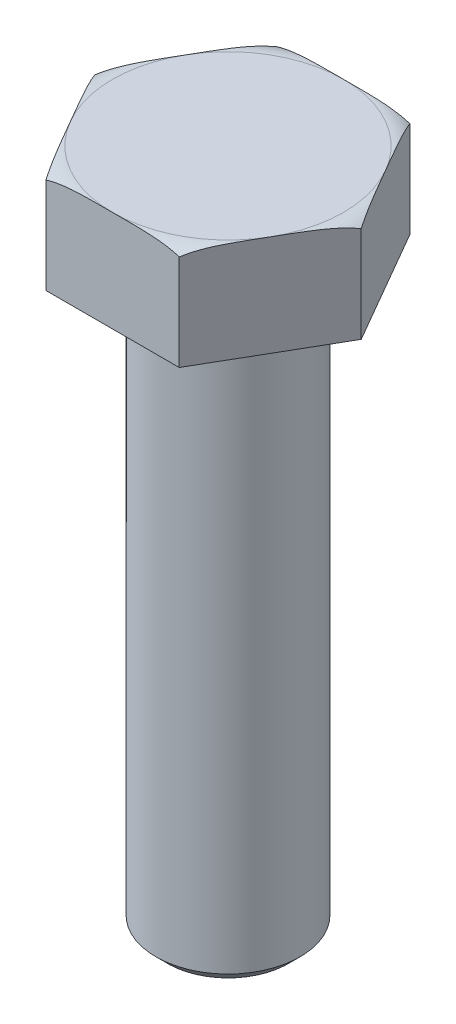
ISO-10303-21;
HEADER;
FILE_DESCRIPTION(('STEP AP214'),'2;1');
FILE_NAME('part.step','',(''),(''),'','','');
FILE_SCHEMA(('AUTOMOTIVE_DESIGN { 1 0 10303 214 1 1 1 1 }'));
ENDSEC;
DATA;
#1=APPLICATION_CONTEXT('core data for automotive mechanical design processes');
#2=APPLICATION_PROTOCOL_DEFINITION('international standard','automotive_design',2000,#1);
#3=PRODUCT_CONTEXT('',#1,'mechanical');
#4=PRODUCT('Part','Part','',(#3));
#5=PRODUCT_RELATED_PRODUCT_CATEGORY('part','',(#4));
#6=PRODUCT_DEFINITION_FORMATION('','',#4);
#7=PRODUCT_DEFINITION_CONTEXT('part definition',#1,'design');
#8=PRODUCT_DEFINITION('design','',#6,#7);
#9=PRODUCT_DEFINITION_SHAPE('','',#8);
#10=(LENGTH_UNIT() NAMED_UNIT(*) SI_UNIT(.MILLI.,.METRE.));
#11=(NAMED_UNIT(*) PLANE_ANGLE_UNIT() SI_UNIT($,.RADIAN.));
#12=(NAMED_UNIT(*) SI_UNIT($,.STERADIAN.) SOLID_ANGLE_UNIT());
#13=UNCERTAINTY_MEASURE_WITH_UNIT(LENGTH_MEASURE(1.E-05),#10,'distance_accuracy_value','');
#14=(GEOMETRIC_REPRESENTATION_CONTEXT(3) GLOBAL_UNCERTAINTY_ASSIGNED_CONTEXT((#13)) GLOBAL_UNIT_ASSIGNED_CONTEXT((#10,
#11,#12)) REPRESENTATION_CONTEXT('',''));
#15=CARTESIAN_POINT('',(0.,0.,0.));
#16=DIRECTION('',(0.,0.,1.));
#17=DIRECTION('',(1.,0.,0.));
#18=AXIS2_PLACEMENT_3D('',#15,#16,#17);
#19=CARTESIAN_POINT('',(2.1,-20.,0.));
#20=DIRECTION('',(0.,1.,0.));
#21=DIRECTION('',(-1.,0.,0.));
#22=AXIS2_PLACEMENT_3D('',#19,#20,#21);
#23=PLANE('',#22);
#24=CARTESIAN_POINT('',(0.,-20.,0.));
#25=DIRECTION('',(0.,1.,0.));
#26=DIRECTION('',(-1.,0.,0.));
#27=AXIS2_PLACEMENT_3D('',#24,#25,#26);
#28=CIRCLE('',#27,2.1);
#29=CARTESIAN_POINT('',(-2.1,-20.,0.));
#30=VERTEX_POINT('',#29);
#31=EDGE_CURVE('E13',#30,#30,#28,.T.);
#32=ORIENTED_EDGE('',*,*,#31,.F.);
#33=EDGE_LOOP('',(#32));
#34=FACE_BOUND('',#33,.T.);
#35=ADVANCED_FACE('F59',(#34),#23,.F.);
#36=CARTESIAN_POINT('',(0.,-20.,0.));
#37=DIRECTION('',(0.,1.,0.));
#38=DIRECTION('',(-1.,0.,0.));
#39=AXIS2_PLACEMENT_3D('',#36,#37,#38);
#40=CONICAL_SURFACE('',#39,2.1,0.785398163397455);
#41=CARTESIAN_POINT('',(0.,-19.6,0.));
#42=DIRECTION('',(0.,1.,0.));
#43=DIRECTION('',(-1.,0.,0.));
#44=AXIS2_PLACEMENT_3D('',#41,#42,#43);
#45=CIRCLE('',#44,2.5);
#46=CARTESIAN_POINT('',(-2.5,-19.6,0.));
#47=VERTEX_POINT('',#46);
#48=EDGE_CURVE('E65',#47,#47,#45,.T.);
#49=ORIENTED_EDGE('',*,*,#48,.F.);
#50=EDGE_LOOP('',(#49));
#51=FACE_BOUND('',#50,.T.);
#52=ORIENTED_EDGE('',*,*,#31,.T.);
#53=EDGE_LOOP('',(#52));
#54=FACE_BOUND('',#53,.T.);
#55=ADVANCED_FACE('F92',(#51,#54),#40,.T.);
#56=CARTESIAN_POINT('',(0.,0.,0.));
#57=DIRECTION('',(0.,1.,0.));
#58=DIRECTION('',(-1.,0.,0.));
#59=AXIS2_PLACEMENT_3D('',#56,#57,#58);
#60=CYLINDRICAL_SURFACE('',#59,2.5);
#61=CARTESIAN_POINT('',(0.,-0.25,0.));
#62=DIRECTION('',(0.,1.,0.));
#63=DIRECTION('',(-1.,0.,0.));
#64=AXIS2_PLACEMENT_3D('',#61,#62,#63);
#65=CIRCLE('',#64,2.5);
#66=CARTESIAN_POINT('',(-2.49999999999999,-0.25,0.));
#67=VERTEX_POINT('',#66);
#68=EDGE_CURVE('E69',#67,#67,#65,.T.);
#69=ORIENTED_EDGE('',*,*,#68,.F.);
#70=EDGE_LOOP('',(#69));
#71=FACE_BOUND('',#70,.T.);
#72=ORIENTED_EDGE('',*,*,#48,.T.);
#73=EDGE_LOOP('',(#72));
#74=FACE_BOUND('',#73,.T.);
#75=ADVANCED_FACE('F87',(#71,#74),#60,.T.);
#76=CARTESIAN_POINT('',(0.,-0.25,0.));
#77=DIRECTION('',(0.,1.,0.));
#78=DIRECTION('',(-1.,0.,0.));
#79=AXIS2_PLACEMENT_3D('',#76,#77,#78);
#80=TOROIDAL_SURFACE('',#79,2.75,0.25);
#81=CARTESIAN_POINT('',(0.,0.,0.));
#82=DIRECTION('',(0.,1.,0.));
#83=DIRECTION('',(-1.,0.,0.));
#84=AXIS2_PLACEMENT_3D('',#81,#82,#83);
#85=CIRCLE('',#84,2.75);
#86=CARTESIAN_POINT('',(-2.74999999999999,0.,0.));
#87=VERTEX_POINT('',#86);
#88=EDGE_CURVE('E73',#87,#87,#85,.T.);
#89=ORIENTED_EDGE('',*,*,#88,.F.);
#90=EDGE_LOOP('',(#89));
#91=FACE_BOUND('',#90,.T.);
#92=ORIENTED_EDGE('',*,*,#68,.T.);
#93=EDGE_LOOP('',(#92));
#94=FACE_BOUND('',#93,.T.);
#95=ADVANCED_FACE('F84',(#91,#94),#80,.F.);
#96=CARTESIAN_POINT('',(0.,0.,0.));
#97=DIRECTION('',(0.,-1.,0.));
#98=DIRECTION('',(1.,0.,0.));
#99=AXIS2_PLACEMENT_3D('',#96,#97,#98);
#100=PLANE('',#99);
#101=ORIENTED_EDGE('',*,*,#88,.T.);
#102=EDGE_LOOP('',(#101));
#103=FACE_BOUND('',#102,.T.);
#104=ADVANCED_FACE('F82',(#103),#100,.F.);
#105=CLOSED_SHELL('',(#35,#55,#75,#95,#104));
#106=MANIFOLD_SOLID_BREP('B2',#105);
#107=CARTESIAN_POINT('',(2.3094010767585,3.5,4.));
#108=DIRECTION('',(-0.866025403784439,0.,-0.5));
#109=DIRECTION('',(-0.5,0.,0.866025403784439));
#110=AXIS2_PLACEMENT_3D('',#107,#108,#109);
#111=PLANE('',#110);
#112=CARTESIAN_POINT('',(2.30928560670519,3.32229848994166,4.00019999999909));
#113=CARTESIAN_POINT('',(2.33858994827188,3.34061994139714,3.94944339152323));
#114=CARTESIAN_POINT('',(2.36819944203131,3.35683646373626,3.8981582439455));
#115=CARTESIAN_POINT('',(2.42782076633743,3.38563718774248,3.79489108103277));
#116=CARTESIAN_POINT('',(2.4578320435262,3.39822593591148,3.74291002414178));
#117=CARTESIAN_POINT('',(2.51792993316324,3.42032057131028,3.63881742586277));
#118=CARTESIAN_POINT('',(2.54801482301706,3.42984574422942,3.58670886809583));
#119=CARTESIAN_POINT('',(2.60836185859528,3.44643059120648,3.48218473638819));
#120=CARTESIAN_POINT('',(2.63862406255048,3.45348940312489,3.42976906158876));
#121=CARTESIAN_POINT('',(2.72922878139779,3.47159999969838,3.27283708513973));
#122=CARTESIAN_POINT('',(2.78971625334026,3.47969499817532,3.16806971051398));
#123=CARTESIAN_POINT('',(2.91090807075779,3.49106106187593,2.95815932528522));
#124=CARTESIAN_POINT('',(2.97161260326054,3.49432175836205,2.85301599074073));
#125=CARTESIAN_POINT('',(3.0983551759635,3.4985657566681,2.6334914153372));
#126=CARTESIAN_POINT('',(3.16439466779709,3.49932457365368,2.5191076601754));
#127=CARTESIAN_POINT('',(3.29646606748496,3.5000407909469,2.29035328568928));
#128=CARTESIAN_POINT('',(3.36249797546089,3.49999826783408,2.17598266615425));
#129=CARTESIAN_POINT('',(3.49443332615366,3.50000138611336,1.94746393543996));
#130=CARTESIAN_POINT('',(3.56033676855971,3.5000468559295,1.83331582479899));
#131=CARTESIAN_POINT('',(3.69217755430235,3.499805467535,1.60496088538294));
#132=CARTESIAN_POINT('',(3.75811489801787,3.4995184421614,1.49075405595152));
#133=CARTESIAN_POINT('',(3.89072417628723,3.49692440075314,1.26106804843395));
#134=CARTESIAN_POINT('',(3.95739603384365,3.4945947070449,1.14558900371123));
#135=CARTESIAN_POINT('',(4.09058235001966,3.4850462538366,0.914903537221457));
#136=CARTESIAN_POINT('',(4.15709689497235,3.47783480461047,0.799696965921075));
#137=CARTESIAN_POINT('',(4.25676848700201,3.46042721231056,0.627060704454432));
#138=CARTESIAN_POINT('',(4.29006368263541,3.45349911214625,0.569391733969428));
#139=CARTESIAN_POINT('',(4.35646708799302,3.43683502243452,0.454377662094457));
#140=CARTESIAN_POINT('',(4.389575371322,3.42710023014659,0.397032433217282));
#141=CARTESIAN_POINT('',(4.45567964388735,3.40410862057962,0.282536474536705));
#142=CARTESIAN_POINT('',(4.48867406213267,3.39083307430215,0.22538846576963));
#143=CARTESIAN_POINT('',(4.55420607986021,3.35998613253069,0.111883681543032));
#144=CARTESIAN_POINT('',(4.58674289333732,3.34240812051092,0.0555282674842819));
#145=CARTESIAN_POINT('',(4.61891762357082,3.32229848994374,-0.000199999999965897));
#146=B_SPLINE_CURVE_WITH_KNOTS('',3,(#112,#113,#114,#115,#116,#117,#118,#119,#120,#121,#122,
#123,#124,#125,#126,#127,#128,#129,#130,#131,#132,#133,#134,#135,#136,#137,#138,#139,#140,#141,
#142,#143,#144,#145),.UNSPECIFIED.,.F.,.F.,(4,2,2,2,2,2,2,2,2,2,2,2,2,2,2,2,4),(0.,
0.184112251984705,0.367992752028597,0.550691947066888,0.733454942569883,1.09699737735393,
1.46131842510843,1.85754929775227,2.25374230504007,2.64916356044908,3.04478370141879,
3.44485242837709,3.84432338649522,4.04512521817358,4.24584151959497,4.44764133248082,
4.64975345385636),.UNSPECIFIED.);
#147=CARTESIAN_POINT('',(2.30940107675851,3.32237074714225,4.));
#148=VERTEX_POINT('',#147);
#149=CARTESIAN_POINT('',(3.46410161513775,3.5,2.));
#150=VERTEX_POINT('',#149);
#151=EDGE_CURVE('E221',#148,#150,#146,.T.);
#152=ORIENTED_EDGE('',*,*,#151,.F.);
#153=DIRECTION('',(0.,-1.,0.));
#154=VECTOR('',#153,1.);
#155=CARTESIAN_POINT('',(2.3094010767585,3.5,4.));
#156=LINE('',#155,#154);
#157=CARTESIAN_POINT('',(2.3094010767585,0.,4.));
#158=VERTEX_POINT('',#157);
#159=EDGE_CURVE('E447',#148,#158,#156,.T.);
#160=ORIENTED_EDGE('',*,*,#159,.T.);
#161=DIRECTION('',(0.5,0.,-0.866025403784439));
#162=VECTOR('',#161,1.);
#163=CARTESIAN_POINT('',(2.3094010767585,0.,4.));
#164=LINE('',#163,#162);
#165=CARTESIAN_POINT('',(4.61880215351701,0.,0.));
#166=VERTEX_POINT('',#165);
#167=EDGE_CURVE('E234',#158,#166,#164,.T.);
#168=ORIENTED_EDGE('',*,*,#167,.T.);
#169=DIRECTION('',(0.,-1.,0.));
#170=VECTOR('',#169,1.);
#171=CARTESIAN_POINT('',(4.61880215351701,3.5,0.));
#172=LINE('',#171,#170);
#173=CARTESIAN_POINT('',(4.61880215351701,3.32237074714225,0.));
#174=VERTEX_POINT('',#173);
#175=EDGE_CURVE('E227',#174,#166,#172,.T.);
#176=ORIENTED_EDGE('',*,*,#175,.F.);
#177=EDGE_CURVE('E211',#150,#174,#146,.T.);
#178=ORIENTED_EDGE('',*,*,#177,.F.);
#179=EDGE_LOOP('',(#152,#160,#168,#176,#178));
#180=FACE_BOUND('',#179,.T.);
#181=ADVANCED_FACE('F138',(#180),#111,.F.);
#182=CARTESIAN_POINT('',(4.61880215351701,3.5,0.));
#183=DIRECTION('',(-0.866025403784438,0.,0.5));
#184=DIRECTION('',(0.5,0.,0.866025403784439));
#185=AXIS2_PLACEMENT_3D('',#182,#183,#184);
#186=PLANE('',#185);
#187=CARTESIAN_POINT('',(4.61891762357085,3.32229848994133,0.000199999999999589));
#188=CARTESIAN_POINT('',(4.58961328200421,3.34061994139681,-0.050556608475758));
#189=CARTESIAN_POINT('',(4.56000378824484,3.35683646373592,-0.101841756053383));
#190=CARTESIAN_POINT('',(4.50038246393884,3.38563718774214,-0.205108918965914));
#191=CARTESIAN_POINT('',(4.47037118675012,3.39822593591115,-0.257089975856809));
#192=CARTESIAN_POINT('',(4.41027329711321,3.42032057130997,-0.36118257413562));
#193=CARTESIAN_POINT('',(4.38018840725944,3.42984574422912,-0.413291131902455));
#194=CARTESIAN_POINT('',(4.31984137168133,3.4464305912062,-0.5178152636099));
#195=CARTESIAN_POINT('',(4.28957916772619,3.45348940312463,-0.57023093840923));
#196=CARTESIAN_POINT('',(4.19897444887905,3.47159999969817,-0.727162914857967));
#197=CARTESIAN_POINT('',(4.13848697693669,3.47969499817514,-0.831930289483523));
#198=CARTESIAN_POINT('',(4.01729515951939,3.49106106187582,-1.0418406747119));
#199=CARTESIAN_POINT('',(3.95659062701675,3.49432175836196,-1.1469840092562));
#200=CARTESIAN_POINT('',(3.82984805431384,3.49856575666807,-1.36650858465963));
#201=CARTESIAN_POINT('',(3.76380856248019,3.49932457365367,-1.48089233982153));
#202=CARTESIAN_POINT('',(3.63173716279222,3.5000407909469,-1.70964671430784));
#203=CARTESIAN_POINT('',(3.56570525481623,3.49999826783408,-1.82401733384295));
#204=CARTESIAN_POINT('',(3.43376990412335,3.50000138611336,-2.05253606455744));
#205=CARTESIAN_POINT('',(3.36786646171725,3.5000468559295,-2.16668417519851));
#206=CARTESIAN_POINT('',(3.2360256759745,3.49980546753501,-2.39503911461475));
#207=CARTESIAN_POINT('',(3.17008833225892,3.49951844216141,-2.50924594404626));
#208=CARTESIAN_POINT('',(3.03747905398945,3.49692440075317,-2.73893195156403));
#209=CARTESIAN_POINT('',(2.97080719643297,3.49459470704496,-2.85441099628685));
#210=CARTESIAN_POINT('',(2.83762088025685,3.4850462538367,-3.08509646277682));
#211=CARTESIAN_POINT('',(2.7711063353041,3.47783480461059,-3.2003030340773));
#212=CARTESIAN_POINT('',(2.67143474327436,3.46042721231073,-3.37293929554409));
#213=CARTESIAN_POINT('',(2.63813954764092,3.45349911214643,-3.43060826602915));
#214=CARTESIAN_POINT('',(2.57173614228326,3.43683502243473,-3.54562233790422));
#215=CARTESIAN_POINT('',(2.53862785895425,3.42710023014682,-3.60296756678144));
#216=CARTESIAN_POINT('',(2.47252358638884,3.40410862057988,-3.71746352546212));
#217=CARTESIAN_POINT('',(2.43952916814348,3.39083307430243,-3.77461153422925));
#218=CARTESIAN_POINT('',(2.37399715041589,3.359986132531,-3.88811631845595));
#219=CARTESIAN_POINT('',(2.34146033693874,3.34240812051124,-3.94447173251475));
#220=CARTESIAN_POINT('',(2.30928560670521,3.32229848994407,-4.00019999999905));
#221=B_SPLINE_CURVE_WITH_KNOTS('',3,(#187,#188,#189,#190,#191,#192,#193,#194,#195,#196,#197,
#198,#199,#200,#201,#202,#203,#204,#205,#206,#207,#208,#209,#210,#211,#212,#213,#214,#215,#216,
#217,#218,#219,#220),.UNSPECIFIED.,.F.,.F.,(4,2,2,2,2,2,2,2,2,2,2,2,2,2,2,2,4),(0.,
0.184112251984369,0.367992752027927,0.550691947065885,0.733454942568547,1.09699737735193,
1.46131842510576,1.85754929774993,2.25374230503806,2.6491635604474,3.04478370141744,
3.44485242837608,3.84432338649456,4.04512521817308,4.24584151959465,4.44764133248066,
4.64975345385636),.UNSPECIFIED.);
#222=CARTESIAN_POINT('',(3.46410161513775,3.5,-2.));
#223=VERTEX_POINT('',#222);
#224=EDGE_CURVE('E214',#174,#223,#221,.T.);
#225=ORIENTED_EDGE('',*,*,#224,.F.);
#226=ORIENTED_EDGE('',*,*,#175,.T.);
#227=DIRECTION('',(-0.5,0.,-0.866025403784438));
#228=VECTOR('',#227,1.);
#229=CARTESIAN_POINT('',(4.61880215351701,0.,0.));
#230=LINE('',#229,#228);
#231=CARTESIAN_POINT('',(2.3094010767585,0.,-4.));
#232=VERTEX_POINT('',#231);
#233=EDGE_CURVE('E455',#166,#232,#230,.T.);
#234=ORIENTED_EDGE('',*,*,#233,.T.);
#235=DIRECTION('',(0.,-1.,0.));
#236=VECTOR('',#235,1.);
#237=CARTESIAN_POINT('',(2.3094010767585,3.5,-4.));
#238=LINE('',#237,#236);
#239=CARTESIAN_POINT('',(2.30940107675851,3.32237074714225,-4.));
#240=VERTEX_POINT('',#239);
#241=EDGE_CURVE('E235',#240,#232,#238,.T.);
#242=ORIENTED_EDGE('',*,*,#241,.F.);
#243=EDGE_CURVE('E230',#223,#240,#221,.T.);
#244=ORIENTED_EDGE('',*,*,#243,.F.);
#245=EDGE_LOOP('',(#225,#226,#234,#242,#244));
#246=FACE_BOUND('',#245,.T.);
#247=ADVANCED_FACE('F225',(#246),#186,.F.);
#248=CARTESIAN_POINT('',(2.3094010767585,3.5,-4.));
#249=DIRECTION('',(0.,0.,1.));
#250=DIRECTION('',(1.,0.,0.));
#251=AXIS2_PLACEMENT_3D('',#248,#249,#250);
#252=PLANE('',#251);
#253=CARTESIAN_POINT('',(0.,3.50000000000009,-4.));
#254=CARTESIAN_POINT('',(-0.0984238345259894,3.50000204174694,-4.));
#255=CARTESIAN_POINT('',(-0.196847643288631,3.50001756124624,-4.));
#256=CARTESIAN_POINT('',(-0.393699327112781,3.49988090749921,-4.));
#257=CARTESIAN_POINT('',(-0.492127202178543,3.49972872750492,-4.));
#258=CARTESIAN_POINT('',(-0.689242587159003,3.49865784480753,-4.));
#259=CARTESIAN_POINT('',(-0.787930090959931,3.4977371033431,-4.));
#260=CARTESIAN_POINT('',(-0.985271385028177,3.49417077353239,-4.));
#261=CARTESIAN_POINT('',(-1.08392517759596,3.49152534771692,-4.));
#262=CARTESIAN_POINT('',(-1.27995563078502,3.48328405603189,-4.));
#263=CARTESIAN_POINT('',(-1.3773336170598,3.47772339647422,-4.));
#264=CARTESIAN_POINT('',(-1.57181106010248,3.46215104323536,-4.));
#265=CARTESIAN_POINT('',(-1.66891035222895,3.45213711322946,-4.));
#266=CARTESIAN_POINT('',(-1.86175967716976,3.4259136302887,-4.));
#267=CARTESIAN_POINT('',(-1.95751418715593,3.40973831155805,-4.));
#268=CARTESIAN_POINT('',(-2.1472085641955,3.3690806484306,-4.));
#269=CARTESIAN_POINT('',(-2.24115096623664,3.34461095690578,-4.));
#270=CARTESIAN_POINT('',(-2.36698878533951,3.3038515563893,-4.));
#271=CARTESIAN_POINT('',(-2.40040963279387,3.29223214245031,-4.));
#272=CARTESIAN_POINT('',(-2.46667384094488,3.26741232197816,-4.));
#273=CARTESIAN_POINT('',(-2.49951695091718,3.2542112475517,-4.));
#274=CARTESIAN_POINT('',(-2.59705409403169,3.21198459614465,-4.));
#275=CARTESIAN_POINT('',(-2.66066653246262,3.18036356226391,-4.));
#276=CARTESIAN_POINT('',(-2.78385342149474,3.10876454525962,-4.));
#277=CARTESIAN_POINT('',(-2.84338598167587,3.068713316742,-4.));
#278=CARTESIAN_POINT('',(-2.95514316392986,2.97940884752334,-4.));
#279=CARTESIAN_POINT('',(-3.00738333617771,2.93017572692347,-4.));
#280=CARTESIAN_POINT('',(-3.08626839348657,2.83910920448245,-4.));
#281=CARTESIAN_POINT('',(-3.11580506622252,2.79978834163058,-4.));
#282=CARTESIAN_POINT('',(-3.16827144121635,2.71692654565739,-4.));
#283=CARTESIAN_POINT('',(-3.19120541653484,2.67338836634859,-4.));
#284=CARTESIAN_POINT('',(-3.22913492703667,2.58247763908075,-4.));
#285=CARTESIAN_POINT('',(-3.24405901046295,2.53507478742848,-4.));
#286=CARTESIAN_POINT('',(-3.26438738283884,2.43826449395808,-4.));
#287=CARTESIAN_POINT('',(-3.26979937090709,2.38885870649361,-4.));
#288=CARTESIAN_POINT('',(-3.27057062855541,2.29624042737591,-4.));
#289=CARTESIAN_POINT('',(-3.26711325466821,2.25303384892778,-4.));
#290=CARTESIAN_POINT('',(-3.25283374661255,2.16786613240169,-4.));
#291=CARTESIAN_POINT('',(-3.24201151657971,2.12590501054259,-4.));
#292=CARTESIAN_POINT('',(-3.21397844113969,2.04504700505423,-4.));
#293=CARTESIAN_POINT('',(-3.196885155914,2.00610877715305,-4.));
#294=CARTESIAN_POINT('',(-3.15722937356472,1.93115542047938,-4.));
#295=CARTESIAN_POINT('',(-3.13466536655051,1.89514110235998,-4.));
#296=CARTESIAN_POINT('',(-3.0732682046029,1.810087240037,-4.));
#297=CARTESIAN_POINT('',(-3.03179040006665,1.76295429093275,-4.));
#298=CARTESIAN_POINT('',(-2.94180263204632,1.67591698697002,-4.));
#299=CARTESIAN_POINT('',(-2.8932730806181,1.63603348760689,-4.));
#300=CARTESIAN_POINT('',(-2.76486507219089,1.54409171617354,-4.));
#301=CARTESIAN_POINT('',(-2.68181306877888,1.49649547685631,-4.));
#302=CARTESIAN_POINT('',(-2.50977333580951,1.41450451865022,-4.));
#303=CARTESIAN_POINT('',(-2.42078730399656,1.38010604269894,-4.));
#304=CARTESIAN_POINT('',(-2.2183358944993,1.31483746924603,-4.));
#305=CARTESIAN_POINT('',(-2.10401808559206,1.28668021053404,-4.));
#306=CARTESIAN_POINT('',(-1.87308597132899,1.2417666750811,-4.));
#307=CARTESIAN_POINT('',(-1.75646723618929,1.22503517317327,-4.));
#308=CARTESIAN_POINT('',(-1.52089459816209,1.19930209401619,-4.));
#309=CARTESIAN_POINT('',(-1.4019301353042,1.1904048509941,-4.));
#310=CARTESIAN_POINT('',(-1.16394096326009,1.17771569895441,-4.));
#311=CARTESIAN_POINT('',(-1.04491658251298,1.17391651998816,-4.));
#312=CARTESIAN_POINT('',(-0.79038010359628,1.16868527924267,-4.));
#313=CARTESIAN_POINT('',(-0.654861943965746,1.16765276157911,-4.));
#314=CARTESIAN_POINT('',(-0.383813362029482,1.16664690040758,-4.));
#315=CARTESIAN_POINT('',(-0.248282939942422,1.16667366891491,-4.));
#316=CARTESIAN_POINT('',(0.0233898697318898,1.166661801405,-4.));
#317=CARTESIAN_POINT('',(0.159532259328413,1.16662286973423,-4.));
#318=CARTESIAN_POINT('',(0.431790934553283,1.16681252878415,-4.));
#319=CARTESIAN_POINT('',(0.567907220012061,1.16704106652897,-4.));
#320=CARTESIAN_POINT('',(0.837544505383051,1.16951094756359,-4.));
#321=CARTESIAN_POINT('',(0.971065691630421,1.17171397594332,-4.));
#322=CARTESIAN_POINT('',(1.23812650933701,1.18091154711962,-4.));
#323=CARTESIAN_POINT('',(1.37166602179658,1.18791095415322,-4.));
#324=CARTESIAN_POINT('',(1.63688400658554,1.21044684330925,-4.));
#325=CARTESIAN_POINT('',(1.76856844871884,1.22590652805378,-4.));
#326=CARTESIAN_POINT('',(2.02963494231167,1.27005998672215,-4.));
#327=CARTESIAN_POINT('',(2.15902229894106,1.2987175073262,-4.));
#328=CARTESIAN_POINT('',(2.32905429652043,1.35011179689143,-4.));
#329=CARTESIAN_POINT('',(2.37226032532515,1.36441046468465,-4.));
#330=CARTESIAN_POINT('',(2.45778898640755,1.39559186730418,-4.));
#331=CARTESIAN_POINT('',(2.50011068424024,1.41247719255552,-4.));
#332=CARTESIAN_POINT('',(2.58344123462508,1.44908606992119,-4.));
#333=CARTESIAN_POINT('',(2.62445203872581,1.46880513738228,-4.));
#334=CARTESIAN_POINT('',(2.70478285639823,1.51138902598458,-4.));
#335=CARTESIAN_POINT('',(2.7441038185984,1.5342520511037,-4.));
#336=CARTESIAN_POINT('',(2.83587742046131,1.59328862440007,-4.));
#337=CARTESIAN_POINT('',(2.88728502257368,1.6311265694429,-4.));
#338=CARTESIAN_POINT('',(2.98378213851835,1.71423882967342,-4.));
#339=CARTESIAN_POINT('',(3.02887638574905,1.75950751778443,-4.));
#340=CARTESIAN_POINT('',(3.10080058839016,1.84644551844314,-4.));
#341=CARTESIAN_POINT('',(3.12945261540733,1.88659723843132,-4.));
#342=CARTESIAN_POINT('',(3.17985272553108,1.97104210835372,-4.));
#343=CARTESIAN_POINT('',(3.20160687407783,2.01533157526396,-4.));
#344=CARTESIAN_POINT('',(3.2368862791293,2.10757178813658,-4.));
#345=CARTESIAN_POINT('',(3.25033810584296,2.1555510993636,-4.));
#346=CARTESIAN_POINT('',(3.26752561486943,2.25322662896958,-4.));
#347=CARTESIAN_POINT('',(3.27126797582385,2.30292164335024,-4.));
#348=CARTESIAN_POINT('',(3.26888293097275,2.39525918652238,-4.));
#349=CARTESIAN_POINT('',(3.26403091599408,2.43793999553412,-4.));
#350=CARTESIAN_POINT('',(3.24719648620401,2.52185590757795,-4.));
#351=CARTESIAN_POINT('',(3.23521437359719,2.56309107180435,-4.));
#352=CARTESIAN_POINT('',(3.20491370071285,2.64304301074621,-4.));
#353=CARTESIAN_POINT('',(3.18660702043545,2.68176434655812,-4.));
#354=CARTESIAN_POINT('',(3.14462789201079,2.75615779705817,-4.));
#355=CARTESIAN_POINT('',(3.12095283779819,2.7918284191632,-4.));
#356=CARTESIAN_POINT('',(3.05619787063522,2.87692318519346,-4.));
#357=CARTESIAN_POINT('',(3.01235182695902,2.9242455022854,-4.));
#358=CARTESIAN_POINT('',(2.91767841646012,3.01127629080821,-4.));
#359=CARTESIAN_POINT('',(2.86683563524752,3.05096747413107,-4.));
#360=CARTESIAN_POINT('',(2.73169439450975,3.14281653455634,-4.));
#361=CARTESIAN_POINT('',(2.64414165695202,3.19015228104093,-4.));
#362=CARTESIAN_POINT('',(2.46302905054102,3.2711501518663,-4.));
#363=CARTESIAN_POINT('',(2.36945654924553,3.30478235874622,-4.));
#364=CARTESIAN_POINT('',(2.14863512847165,3.37044260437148,-4.));
#365=CARTESIAN_POINT('',(2.02023171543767,3.39847806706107,-4.));
#366=CARTESIAN_POINT('',(1.7611969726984,3.4417065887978,-4.));
#367=CARTESIAN_POINT('',(1.63056096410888,3.45686808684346,-4.));
#368=CARTESIAN_POINT('',(1.3681657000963,3.47893730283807,-4.));
#369=CARTESIAN_POINT('',(1.23640406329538,3.48581347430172,-4.));
#370=CARTESIAN_POINT('',(0.972881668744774,3.49489111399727,-4.));
#371=CARTESIAN_POINT('',(0.841121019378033,3.49709683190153,-4.));
#372=CARTESIAN_POINT('',(0.591194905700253,3.49943479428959,-4.));
#373=CARTESIAN_POINT('',(0.473030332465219,3.49975760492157,-4.));
#374=CARTESIAN_POINT('',(0.295710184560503,3.49996260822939,-4.));
#375=CARTESIAN_POINT('',(0.236554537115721,3.49998433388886,-4.));
#376=CARTESIAN_POINT('',(0.118265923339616,3.50000241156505,-4.));
#377=CARTESIAN_POINT('',(0.0591329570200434,3.4999987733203,-4.));
#378=CARTESIAN_POINT('',(0.,3.50000000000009,-4.));
#379=B_SPLINE_CURVE_WITH_KNOTS('',3,(#253,#254,#255,#256,#257,#258,#259,#260,#261,#262,#263,
#264,#265,#266,#267,#268,#269,#270,#271,#272,#273,#274,#275,#276,#277,#278,#279,#280,#281,#282,
#283,#284,#285,#286,#287,#288,#289,#290,#291,#292,#293,#294,#295,#296,#297,#298,#299,#300,#301,
#302,#303,#304,#305,#306,#307,#308,#309,#310,#311,#312,#313,#314,#315,#316,#317,#318,#319,#320,
#321,#322,#323,#324,#325,#326,#327,#328,#329,#330,#331,#332,#333,#334,#335,#336,#337,#338,#339,
#340,#341,#342,#343,#344,#345,#346,#347,#348,#349,#350,#351,#352,#353,#354,#355,#356,#357,#358,
#359,#360,#361,#362,#363,#364,#365,#366,#367,#368,#369,#370,#371,#372,#373,#374,#375,#376,#377,
#378),.UNSPECIFIED.,.T.,.F.,(4,2,2,2,2,2,2,2,2,2,2,2,2,2,2,2,2,2,2,2,2,2,2,2,2,2,2,2,2,2,2,2,2,
2,2,2,2,2,2,2,2,2,2,2,2,2,2,2,2,2,2,2,2,2,2,2,2,2,2,2,2,2,4),(0.,0.295271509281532,
0.59055490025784,0.886624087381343,1.18266537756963,1.47521114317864,1.76790398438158,
2.05899372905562,2.34964140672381,2.45575583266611,2.56191522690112,2.77451381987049,
2.98904202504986,3.2031055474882,3.35011848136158,3.49703605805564,3.64524329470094,
3.79333051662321,3.92271383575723,4.05209883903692,4.17917288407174,4.30628204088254,
4.4935746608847,4.68139784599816,4.96694301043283,5.25240682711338,5.60472261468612,
5.9577999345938,6.31551125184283,6.67271192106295,7.07926173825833,7.48585454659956,
7.89428192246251,8.30262841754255,8.70321853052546,9.10421550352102,9.50163142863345,
9.89796213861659,10.0344281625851,10.1710317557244,10.3074214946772,10.4437336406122,
10.6346178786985,10.8253582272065,10.9727780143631,11.1200678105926,11.268642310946,
11.4171145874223,11.5453556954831,11.6735913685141,11.8015874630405,11.9296458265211,
12.122087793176,12.3149607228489,12.6118592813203,12.9094025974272,13.3026129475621,
13.6967845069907,14.0924521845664,14.4877596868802,14.8422531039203,15.0197201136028,
15.1971189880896),.UNSPECIFIED.);
#380=CARTESIAN_POINT('',(0.,3.5,-4.));
#381=VERTEX_POINT('',#380);
#382=EDGE_CURVE('E265',#240,#381,#379,.T.);
#383=ORIENTED_EDGE('',*,*,#382,.F.);
#384=ORIENTED_EDGE('',*,*,#241,.T.);
#385=DIRECTION('',(-1.,0.,0.));
#386=VECTOR('',#385,1.);
#387=CARTESIAN_POINT('',(2.3094010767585,0.,-4.));
#388=LINE('',#387,#386);
#389=CARTESIAN_POINT('',(-2.3094010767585,0.,-4.));
#390=VERTEX_POINT('',#389);
#391=EDGE_CURVE('E469',#232,#390,#388,.T.);
#392=ORIENTED_EDGE('',*,*,#391,.T.);
#393=DIRECTION('',(0.,-1.,0.));
#394=VECTOR('',#393,1.);
#395=CARTESIAN_POINT('',(-2.3094010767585,3.5,-4.));
#396=LINE('',#395,#394);
#397=CARTESIAN_POINT('',(-2.3094010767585,3.32237074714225,-4.));
#398=VERTEX_POINT('',#397);
#399=EDGE_CURVE('E241',#398,#390,#396,.T.);
#400=ORIENTED_EDGE('',*,*,#399,.F.);
#401=EDGE_CURVE('E273',#381,#398,#379,.T.);
#402=ORIENTED_EDGE('',*,*,#401,.F.);
#403=EDGE_LOOP('',(#383,#384,#392,#400,#402));
#404=FACE_BOUND('',#403,.T.);
#405=ADVANCED_FACE('F274',(#404),#252,.F.);
#406=CARTESIAN_POINT('',(-2.3094010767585,3.5,-4.));
#407=DIRECTION('',(0.866025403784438,0.,0.5));
#408=DIRECTION('',(0.5,0.,-0.866025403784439));
#409=AXIS2_PLACEMENT_3D('',#406,#407,#408);
#410=PLANE('',#409);
#411=CARTESIAN_POINT('',(-2.30928560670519,3.32229848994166,-4.00019999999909));
#412=CARTESIAN_POINT('',(-2.33858994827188,3.34061994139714,-3.94944339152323));
#413=CARTESIAN_POINT('',(-2.36819944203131,3.35683646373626,-3.89815824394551));
#414=CARTESIAN_POINT('',(-2.42782076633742,3.38563718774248,-3.79489108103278));
#415=CARTESIAN_POINT('',(-2.4578320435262,3.39822593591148,-3.74291002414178));
#416=CARTESIAN_POINT('',(-2.51792993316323,3.42032057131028,-3.63881742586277));
#417=CARTESIAN_POINT('',(-2.54801482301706,3.42984574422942,-3.58670886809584));
#418=CARTESIAN_POINT('',(-2.60836185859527,3.44643059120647,-3.4821847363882));
#419=CARTESIAN_POINT('',(-2.63862406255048,3.45348940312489,-3.42976906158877));
#420=CARTESIAN_POINT('',(-2.72922878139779,3.47159999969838,-3.27283708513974));
#421=CARTESIAN_POINT('',(-2.78971625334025,3.47969499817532,-3.16806971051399));
#422=CARTESIAN_POINT('',(-2.91090807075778,3.49106106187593,-2.95815932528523));
#423=CARTESIAN_POINT('',(-2.97161260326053,3.49432175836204,-2.85301599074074));
#424=CARTESIAN_POINT('',(-3.0983551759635,3.4985657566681,-2.63349141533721));
#425=CARTESIAN_POINT('',(-3.16439466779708,3.49932457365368,-2.51910766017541));
#426=CARTESIAN_POINT('',(-3.29646606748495,3.5000407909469,-2.29035328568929));
#427=CARTESIAN_POINT('',(-3.36249797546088,3.49999826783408,-2.17598266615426));
#428=CARTESIAN_POINT('',(-3.49443332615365,3.50000138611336,-1.94746393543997));
#429=CARTESIAN_POINT('',(-3.5603367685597,3.5000468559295,-1.833315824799));
#430=CARTESIAN_POINT('',(-3.69217755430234,3.499805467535,-1.60496088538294));
#431=CARTESIAN_POINT('',(-3.75811489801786,3.4995184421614,-1.49075405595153));
#432=CARTESIAN_POINT('',(-3.89072417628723,3.49692440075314,-1.26106804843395));
#433=CARTESIAN_POINT('',(-3.95739603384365,3.4945947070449,-1.14558900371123));
#434=CARTESIAN_POINT('',(-4.09058235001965,3.4850462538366,-0.914903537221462));
#435=CARTESIAN_POINT('',(-4.15709689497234,3.47783480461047,-0.79969696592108));
#436=CARTESIAN_POINT('',(-4.256768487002,3.46042721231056,-0.627060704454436));
#437=CARTESIAN_POINT('',(-4.29006368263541,3.45349911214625,-0.569391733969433));
#438=CARTESIAN_POINT('',(-4.35646708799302,3.43683502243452,-0.454377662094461));
#439=CARTESIAN_POINT('',(-4.389575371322,3.42710023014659,-0.397032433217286));
#440=CARTESIAN_POINT('',(-4.45567964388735,3.40410862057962,-0.282536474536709));
#441=CARTESIAN_POINT('',(-4.48867406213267,3.39083307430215,-0.225388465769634));
#442=CARTESIAN_POINT('',(-4.55420607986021,3.35998613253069,-0.111883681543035));
#443=CARTESIAN_POINT('',(-4.58674289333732,3.34240812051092,-0.0555282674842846));
#444=CARTESIAN_POINT('',(-4.61891762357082,3.32229848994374,0.000199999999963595));
#445=B_SPLINE_CURVE_WITH_KNOTS('',3,(#411,#412,#413,#414,#415,#416,#417,#418,#419,#420,#421,
#422,#423,#424,#425,#426,#427,#428,#429,#430,#431,#432,#433,#434,#435,#436,#437,#438,#439,#440,
#441,#442,#443,#444),.UNSPECIFIED.,.F.,.F.,(4,2,2,2,2,2,2,2,2,2,2,2,2,2,2,2,4),(0.,
0.184112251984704,0.367992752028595,0.550691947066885,0.733454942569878,1.09699737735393,
1.46131842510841,1.85754929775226,2.25374230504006,2.64916356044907,3.04478370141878,
3.44485242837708,3.84432338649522,4.04512521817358,4.24584151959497,4.44764133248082,
4.64975345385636),.UNSPECIFIED.);
#446=CARTESIAN_POINT('',(-3.46410161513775,3.5,-2.));
#447=VERTEX_POINT('',#446);
#448=EDGE_CURVE('E277',#398,#447,#445,.T.);
#449=ORIENTED_EDGE('',*,*,#448,.F.);
#450=ORIENTED_EDGE('',*,*,#399,.T.);
#451=DIRECTION('',(-0.5,0.,0.866025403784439));
#452=VECTOR('',#451,1.);
#453=CARTESIAN_POINT('',(-2.3094010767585,0.,-4.));
#454=LINE('',#453,#452);
#455=CARTESIAN_POINT('',(-4.61880215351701,0.,0.));
#456=VERTEX_POINT('',#455);
#457=EDGE_CURVE('E460',#390,#456,#454,.T.);
#458=ORIENTED_EDGE('',*,*,#457,.T.);
#459=DIRECTION('',(0.,-1.,0.));
#460=VECTOR('',#459,1.);
#461=CARTESIAN_POINT('',(-4.61880215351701,3.5,0.));
#462=LINE('',#461,#460);
#463=CARTESIAN_POINT('',(-4.61880215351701,3.32237074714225,0.));
#464=VERTEX_POINT('',#463);
#465=EDGE_CURVE('E474',#464,#456,#462,.T.);
#466=ORIENTED_EDGE('',*,*,#465,.F.);
#467=EDGE_CURVE('E280',#447,#464,#445,.T.);
#468=ORIENTED_EDGE('',*,*,#467,.F.);
#469=EDGE_LOOP('',(#449,#450,#458,#466,#468));
#470=FACE_BOUND('',#469,.T.);
#471=ADVANCED_FACE('F329',(#470),#410,.F.);
#472=CARTESIAN_POINT('',(-4.61880215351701,3.5,0.));
#473=DIRECTION('',(0.866025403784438,0.,-0.5));
#474=DIRECTION('',(-0.5,0.,-0.866025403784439));
#475=AXIS2_PLACEMENT_3D('',#472,#473,#474);
#476=PLANE('',#475);
#477=CARTESIAN_POINT('',(-4.61891762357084,3.32229848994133,-0.000200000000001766));
#478=CARTESIAN_POINT('',(-4.58961328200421,3.34061994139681,0.0505566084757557));
#479=CARTESIAN_POINT('',(-4.56000378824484,3.35683646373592,0.101841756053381));
#480=CARTESIAN_POINT('',(-4.50038246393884,3.38563718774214,0.205108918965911));
#481=CARTESIAN_POINT('',(-4.47037118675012,3.39822593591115,0.257089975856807));
#482=CARTESIAN_POINT('',(-4.41027329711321,3.42032057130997,0.361182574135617));
#483=CARTESIAN_POINT('',(-4.38018840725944,3.42984574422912,0.413291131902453));
#484=CARTESIAN_POINT('',(-4.31984137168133,3.4464305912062,0.517815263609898));
#485=CARTESIAN_POINT('',(-4.28957916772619,3.45348940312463,0.570230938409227));
#486=CARTESIAN_POINT('',(-4.19897444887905,3.47159999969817,0.727162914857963));
#487=CARTESIAN_POINT('',(-4.13848697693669,3.47969499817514,0.831930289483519));
#488=CARTESIAN_POINT('',(-4.01729515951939,3.49106106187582,1.0418406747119));
#489=CARTESIAN_POINT('',(-3.95659062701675,3.49432175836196,1.14698400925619));
#490=CARTESIAN_POINT('',(-3.82984805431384,3.49856575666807,1.36650858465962));
#491=CARTESIAN_POINT('',(-3.76380856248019,3.49932457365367,1.48089233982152));
#492=CARTESIAN_POINT('',(-3.63173716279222,3.5000407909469,1.70964671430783));
#493=CARTESIAN_POINT('',(-3.56570525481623,3.49999826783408,1.82401733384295));
#494=CARTESIAN_POINT('',(-3.43376990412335,3.50000138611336,2.05253606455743));
#495=CARTESIAN_POINT('',(-3.36786646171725,3.5000468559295,2.1666841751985));
#496=CARTESIAN_POINT('',(-3.2360256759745,3.49980546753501,2.39503911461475));
#497=CARTESIAN_POINT('',(-3.17008833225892,3.49951844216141,2.50924594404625));
#498=CARTESIAN_POINT('',(-3.03747905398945,3.49692440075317,2.73893195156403));
#499=CARTESIAN_POINT('',(-2.97080719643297,3.49459470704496,2.85441099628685));
#500=CARTESIAN_POINT('',(-2.83762088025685,3.4850462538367,3.08509646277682));
#501=CARTESIAN_POINT('',(-2.7711063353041,3.47783480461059,3.2003030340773));
#502=CARTESIAN_POINT('',(-2.67143474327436,3.46042721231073,3.37293929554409));
#503=CARTESIAN_POINT('',(-2.63813954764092,3.45349911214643,3.43060826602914));
#504=CARTESIAN_POINT('',(-2.57173614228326,3.43683502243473,3.54562233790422));
#505=CARTESIAN_POINT('',(-2.53862785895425,3.42710023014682,3.60296756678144));
#506=CARTESIAN_POINT('',(-2.47252358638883,3.40410862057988,3.71746352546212));
#507=CARTESIAN_POINT('',(-2.43952916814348,3.39083307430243,3.77461153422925));
#508=CARTESIAN_POINT('',(-2.37399715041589,3.359986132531,3.88811631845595));
#509=CARTESIAN_POINT('',(-2.34146033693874,3.34240812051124,3.94447173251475));
#510=CARTESIAN_POINT('',(-2.30928560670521,3.32229848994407,4.00019999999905));
#511=B_SPLINE_CURVE_WITH_KNOTS('',3,(#477,#478,#479,#480,#481,#482,#483,#484,#485,#486,#487,
#488,#489,#490,#491,#492,#493,#494,#495,#496,#497,#498,#499,#500,#501,#502,#503,#504,#505,#506,
#507,#508,#509,#510),.UNSPECIFIED.,.F.,.F.,(4,2,2,2,2,2,2,2,2,2,2,2,2,2,2,2,4),(0.,
0.184112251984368,0.367992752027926,0.550691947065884,0.733454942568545,1.09699737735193,
1.46131842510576,1.85754929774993,2.25374230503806,2.6491635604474,3.04478370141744,
3.44485242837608,3.84432338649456,4.04512521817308,4.24584151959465,4.44764133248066,
4.64975345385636),.UNSPECIFIED.);
#512=CARTESIAN_POINT('',(-3.46410161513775,3.5,2.));
#513=VERTEX_POINT('',#512);
#514=EDGE_CURVE('E161',#464,#513,#511,.T.);
#515=ORIENTED_EDGE('',*,*,#514,.F.);
#516=ORIENTED_EDGE('',*,*,#465,.T.);
#517=DIRECTION('',(0.5,0.,0.866025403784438));
#518=VECTOR('',#517,1.);
#519=CARTESIAN_POINT('',(-4.61880215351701,0.,0.));
#520=LINE('',#519,#518);
#521=CARTESIAN_POINT('',(-2.3094010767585,0.,4.));
#522=VERTEX_POINT('',#521);
#523=EDGE_CURVE('E457',#456,#522,#520,.T.);
#524=ORIENTED_EDGE('',*,*,#523,.T.);
#525=DIRECTION('',(0.,-1.,0.));
#526=VECTOR('',#525,1.);
#527=CARTESIAN_POINT('',(-2.3094010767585,3.5,4.));
#528=LINE('',#527,#526);
#529=CARTESIAN_POINT('',(-2.3094010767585,3.32237074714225,4.));
#530=VERTEX_POINT('',#529);
#531=EDGE_CURVE('E450',#530,#522,#528,.T.);
#532=ORIENTED_EDGE('',*,*,#531,.F.);
#533=EDGE_CURVE('E314',#513,#530,#511,.T.);
#534=ORIENTED_EDGE('',*,*,#533,.F.);
#535=EDGE_LOOP('',(#515,#516,#524,#532,#534));
#536=FACE_BOUND('',#535,.T.);
#537=ADVANCED_FACE('F347',(#536),#476,.F.);
#538=CARTESIAN_POINT('',(-2.3094010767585,3.5,4.));
#539=DIRECTION('',(0.,0.,-1.));
#540=DIRECTION('',(-1.,0.,0.));
#541=AXIS2_PLACEMENT_3D('',#538,#539,#540);
#542=PLANE('',#541);
#543=CARTESIAN_POINT('',(0.,3.50000033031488,3.99999966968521));
#544=CARTESIAN_POINT('',(0.0984238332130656,3.50000246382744,3.99999957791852));
#545=CARTESIAN_POINT('',(0.196847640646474,3.50001767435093,3.99999988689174));
#546=CARTESIAN_POINT('',(0.393699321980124,3.49988079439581,4.00000011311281));
#547=CARTESIAN_POINT('',(0.492127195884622,3.49972869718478,4.00000003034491));
#548=CARTESIAN_POINT('',(0.689242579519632,3.4986578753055,3.99999996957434));
#549=CARTESIAN_POINT('',(0.787930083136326,3.49773711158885,3.99999999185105));
#550=CARTESIAN_POINT('',(0.985271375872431,3.49417076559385,4.00000000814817));
#551=CARTESIAN_POINT('',(1.08392516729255,3.49152534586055,4.00000000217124));
#552=CARTESIAN_POINT('',(1.27995562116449,3.48328405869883,3.9999999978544));
#553=CARTESIAN_POINT('',(1.37733360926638,3.47772339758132,3.99999999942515));
#554=CARTESIAN_POINT('',(1.57181105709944,3.4621510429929,4.00000000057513));
#555=CARTESIAN_POINT('',(1.66891035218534,3.45213711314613,4.00000000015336));
#556=CARTESIAN_POINT('',(1.8617596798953,3.42591363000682,3.99999999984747));
#557=CARTESIAN_POINT('',(1.95751418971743,3.40973831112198,3.99999999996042));
#558=CARTESIAN_POINT('',(2.14720856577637,3.3690806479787,4.00000000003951));
#559=CARTESIAN_POINT('',(2.24115096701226,3.34461095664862,4.00000000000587));
#560=CARTESIAN_POINT('',(2.36698878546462,3.30385155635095,3.99999999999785));
#561=CARTESIAN_POINT('',(2.40040963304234,3.29223214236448,3.99999999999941));
#562=CARTESIAN_POINT('',(2.46667384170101,3.26741232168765,4.00000000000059));
#563=CARTESIAN_POINT('',(2.49951695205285,3.25421124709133,4.0000000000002));
#564=CARTESIAN_POINT('',(2.59705409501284,3.21198459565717,3.99999999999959));
#565=CARTESIAN_POINT('',(2.66066653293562,3.18036356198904,3.99999999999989));
#566=CARTESIAN_POINT('',(2.78385342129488,3.10876454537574,4.00000000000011));
#567=CARTESIAN_POINT('',(2.84338598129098,3.06871331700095,4.00000000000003));
#568=CARTESIAN_POINT('',(2.95514316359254,2.97940884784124,3.99999999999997));
#569=CARTESIAN_POINT('',(3.00738333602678,2.93017572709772,3.99999999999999));
#570=CARTESIAN_POINT('',(3.08626839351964,2.83910920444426,4.));
#571=CARTESIAN_POINT('',(3.11580506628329,2.79978834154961,4.));
#572=CARTESIAN_POINT('',(3.16827144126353,2.71692654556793,4.));
#573=CARTESIAN_POINT('',(3.19120541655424,2.6733883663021,4.));
#574=CARTESIAN_POINT('',(3.22913492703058,2.58247763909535,4.));
#575=CARTESIAN_POINT('',(3.24405901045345,2.53507478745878,4.));
#576=CARTESIAN_POINT('',(3.26438738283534,2.43826449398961,4.));
#577=CARTESIAN_POINT('',(3.26979937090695,2.38885870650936,4.));
#578=CARTESIAN_POINT('',(3.27057062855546,2.29624042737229,4.));
#579=CARTESIAN_POINT('',(3.26711325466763,2.25303384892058,4.));
#580=CARTESIAN_POINT('',(3.25283374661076,2.1678661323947,4.));
#581=CARTESIAN_POINT('',(3.24201151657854,2.12590501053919,4.));
#582=CARTESIAN_POINT('',(3.21397844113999,2.04504700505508,4.));
#583=CARTESIAN_POINT('',(3.19688515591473,2.0061087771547,4.));
#584=CARTESIAN_POINT('',(3.15722937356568,1.9311554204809,4.));
#585=CARTESIAN_POINT('',(3.13466536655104,1.89514110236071,4.));
#586=CARTESIAN_POINT('',(3.0732682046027,1.81008724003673,4.));
#587=CARTESIAN_POINT('',(3.03179040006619,1.76295429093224,4.));
#588=CARTESIAN_POINT('',(2.94180263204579,1.67591698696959,4.));
#589=CARTESIAN_POINT('',(2.89327308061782,1.63603348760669,4.));
#590=CARTESIAN_POINT('',(2.76486507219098,1.5440917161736,4.));
#591=CARTESIAN_POINT('',(2.68181306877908,1.49649547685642,4.));
#592=CARTESIAN_POINT('',(2.50977333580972,1.4145045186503,4.));
#593=CARTESIAN_POINT('',(2.42078730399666,1.38010604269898,4.));
#594=CARTESIAN_POINT('',(2.21833589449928,1.31483746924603,4.));
#595=CARTESIAN_POINT('',(2.10401808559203,1.28668021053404,4.));
#596=CARTESIAN_POINT('',(1.87308597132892,1.24176667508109,4.));
#597=CARTESIAN_POINT('',(1.75646723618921,1.22503517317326,4.));
#598=CARTESIAN_POINT('',(1.520894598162,1.19930209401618,4.));
#599=CARTESIAN_POINT('',(1.40193013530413,1.1904048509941,4.));
#600=CARTESIAN_POINT('',(1.16394096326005,1.17771569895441,4.));
#601=CARTESIAN_POINT('',(1.04491658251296,1.17391651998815,4.));
#602=CARTESIAN_POINT('',(0.790380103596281,1.16868527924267,4.));
#603=CARTESIAN_POINT('',(0.654861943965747,1.16765276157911,4.));
#604=CARTESIAN_POINT('',(0.383813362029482,1.16664690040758,4.));
#605=CARTESIAN_POINT('',(0.248282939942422,1.16667366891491,4.));
#606=CARTESIAN_POINT('',(-0.0233898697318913,1.166661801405,4.));
#607=CARTESIAN_POINT('',(-0.159532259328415,1.16662286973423,4.));
#608=CARTESIAN_POINT('',(-0.431790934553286,1.16681252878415,4.));
#609=CARTESIAN_POINT('',(-0.567907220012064,1.16704106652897,4.));
#610=CARTESIAN_POINT('',(-0.837544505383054,1.16951094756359,4.));
#611=CARTESIAN_POINT('',(-0.971065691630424,1.17171397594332,4.));
#612=CARTESIAN_POINT('',(-1.23812650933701,1.18091154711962,4.));
#613=CARTESIAN_POINT('',(-1.37166602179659,1.18791095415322,4.));
#614=CARTESIAN_POINT('',(-1.63688400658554,1.21044684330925,4.));
#615=CARTESIAN_POINT('',(-1.76856844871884,1.22590652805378,4.));
#616=CARTESIAN_POINT('',(-2.02963494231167,1.27005998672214,4.));
#617=CARTESIAN_POINT('',(-2.15902229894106,1.2987175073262,4.));
#618=CARTESIAN_POINT('',(-2.32905429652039,1.35011179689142,4.));
#619=CARTESIAN_POINT('',(-2.37226032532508,1.36441046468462,4.));
#620=CARTESIAN_POINT('',(-2.45778898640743,1.39559186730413,4.));
#621=CARTESIAN_POINT('',(-2.50011068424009,1.41247719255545,4.));
#622=CARTESIAN_POINT('',(-2.58344123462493,1.44908606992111,4.));
#623=CARTESIAN_POINT('',(-2.62445203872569,1.46880513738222,4.));
#624=CARTESIAN_POINT('',(-2.70478285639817,1.51138902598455,4.));
#625=CARTESIAN_POINT('',(-2.74410381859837,1.53425205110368,4.));
#626=CARTESIAN_POINT('',(-2.83587742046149,1.59328862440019,4.));
#627=CARTESIAN_POINT('',(-2.88728502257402,1.63112656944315,4.));
#628=CARTESIAN_POINT('',(-2.98378213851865,1.71423882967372,4.));
#629=CARTESIAN_POINT('',(-3.02887638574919,1.75950751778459,4.));
#630=CARTESIAN_POINT('',(-3.1008005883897,1.8464455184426,4.));
#631=CARTESIAN_POINT('',(-3.1294526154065,1.88659723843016,4.));
#632=CARTESIAN_POINT('',(-3.17985272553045,1.97104210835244,4.));
#633=CARTESIAN_POINT('',(-3.20160687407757,2.01533157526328,4.));
#634=CARTESIAN_POINT('',(-3.23688627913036,2.10757178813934,4.));
#635=CARTESIAN_POINT('',(-3.25033810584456,2.15555109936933,4.));
#636=CARTESIAN_POINT('',(-3.26752561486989,2.25322662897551,4.));
#637=CARTESIAN_POINT('',(-3.27126797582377,2.30292164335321,4.));
#638=CARTESIAN_POINT('',(-3.26888293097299,2.39525918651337,4.));
#639=CARTESIAN_POINT('',(-3.26403091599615,2.43793999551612,4.));
#640=CARTESIAN_POINT('',(-3.24719648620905,2.52185590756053,4.));
#641=CARTESIAN_POINT('',(-3.2352143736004,2.56309107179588,4.));
#642=CARTESIAN_POINT('',(-3.20491370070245,2.64304301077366,3.99999999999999));
#643=CARTESIAN_POINT('',(-3.18660702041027,2.68176434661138,3.99999999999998));
#644=CARTESIAN_POINT('',(-3.14462789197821,2.75615779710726,4.00000000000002));
#645=CARTESIAN_POINT('',(-3.12095283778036,2.79182841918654,4.00000000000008));
#646=CARTESIAN_POINT('',(-3.05619787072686,2.87692318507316,3.99999999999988));
#647=CARTESIAN_POINT('',(-3.01235182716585,2.92424550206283,3.99999999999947));
#648=CARTESIAN_POINT('',(-2.9176784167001,3.01127629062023,4.00000000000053));
#649=CARTESIAN_POINT('',(-2.86683563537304,3.05096747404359,4.00000000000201));
#650=CARTESIAN_POINT('',(-2.73169439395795,3.14281653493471,3.9999999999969));
#651=CARTESIAN_POINT('',(-2.64414165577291,3.19015228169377,3.99999999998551));
#652=CARTESIAN_POINT('',(-2.46302904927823,3.27115015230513,4.00000000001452));
#653=CARTESIAN_POINT('',(-2.36945654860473,3.30478235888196,4.00000000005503));
#654=CARTESIAN_POINT('',(-2.14863512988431,3.37044260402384,3.99999999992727));
#655=CARTESIAN_POINT('',(-2.02023171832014,3.39847806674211,3.99999999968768));
#656=CARTESIAN_POINT('',(-1.76119697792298,3.44170658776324,4.00000000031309));
#657=CARTESIAN_POINT('',(-1.63056097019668,3.45686808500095,4.0000000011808));
#658=CARTESIAN_POINT('',(-1.36816570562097,3.47893730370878,3.99999999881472));
#659=CARTESIAN_POINT('',(-1.23640406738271,3.48581347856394,3.99999999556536));
#660=CARTESIAN_POINT('',(-0.972881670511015,3.49489110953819,4.0000000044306));
#661=CARTESIAN_POINT('',(-0.841121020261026,3.49709681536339,4.00000001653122));
#662=CARTESIAN_POINT('',(-0.591194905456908,3.49943480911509,3.99999998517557));
#663=CARTESIAN_POINT('',(-0.47303033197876,3.49975765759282,3.99999994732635));
#664=CARTESIAN_POINT('',(-0.295710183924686,3.49996258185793,4.00000002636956));
#665=CARTESIAN_POINT('',(-0.236554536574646,3.49998425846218,4.00000007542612));
#666=CARTESIAN_POINT('',(-0.118265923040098,3.50000248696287,3.99999992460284));
#667=CARTESIAN_POINT('',(-0.0591329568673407,3.49999904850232,3.99999972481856));
#668=CARTESIAN_POINT('',(0.,3.50000033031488,3.99999966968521));
#669=B_SPLINE_CURVE_WITH_KNOTS('',3,(#543,#544,#545,#546,#547,#548,#549,#550,#551,#552,#553,
#554,#555,#556,#557,#558,#559,#560,#561,#562,#563,#564,#565,#566,#567,#568,#569,#570,#571,#572,
#573,#574,#575,#576,#577,#578,#579,#580,#581,#582,#583,#584,#585,#586,#587,#588,#589,#590,#591,
#592,#593,#594,#595,#596,#597,#598,#599,#600,#601,#602,#603,#604,#605,#606,#607,#608,#609,#610,
#611,#612,#613,#614,#615,#616,#617,#618,#619,#620,#621,#622,#623,#624,#625,#626,#627,#628,#629,
#630,#631,#632,#633,#634,#635,#636,#637,#638,#639,#640,#641,#642,#643,#644,#645,#646,#647,#648,
#649,#650,#651,#652,#653,#654,#655,#656,#657,#658,#659,#660,#661,#662,#663,#664,#665,#666,#667,
#668),.UNSPECIFIED.,.T.,.F.,(4,2,2,2,2,2,2,2,2,2,2,2,2,2,2,2,2,2,2,2,2,2,2,2,2,2,2,2,2,2,2,2,2,
2,2,2,2,2,2,2,2,2,2,2,2,2,2,2,2,2,2,2,2,2,2,2,2,2,2,2,2,2,4),(0.,0.295271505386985,
0.59055489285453,0.886624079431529,1.18266536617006,1.47521113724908,1.76790398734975,
2.05899373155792,2.34964140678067,2.45575583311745,2.56191522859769,2.77451381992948,
2.98904202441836,3.20310554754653,3.35011848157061,3.49703605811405,3.64524329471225,
3.7933305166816,3.92271383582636,4.0520988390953,4.17917288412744,4.30628204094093,
4.49357466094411,4.68139784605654,4.96694301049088,5.25240682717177,5.60472261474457,
5.9577999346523,6.31551125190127,6.67271192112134,7.07926173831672,7.48585454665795,
7.89428192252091,8.30262841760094,8.70321853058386,9.10421550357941,9.50163142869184,
9.89796213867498,10.0344281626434,10.1710317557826,10.3074214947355,10.4437336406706,
10.6346178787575,10.8253582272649,10.9727780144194,11.120067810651,11.2686423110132,
11.4171145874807,11.5453556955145,11.6735913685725,11.8015874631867,11.9296458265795,
12.1220877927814,12.3149607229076,12.6118592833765,12.9094025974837,13.302612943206,
13.696784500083,14.092452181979,14.4877596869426,14.8422531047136,15.0197201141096,
15.1971189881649),.UNSPECIFIED.);
#670=CARTESIAN_POINT('',(0.,3.5,4.));
#671=VERTEX_POINT('',#670);
#672=EDGE_CURVE('E481',#671,#148,#669,.T.);
#673=ORIENTED_EDGE('',*,*,#672,.F.);
#674=EDGE_CURVE('E153',#530,#671,#669,.T.);
#675=ORIENTED_EDGE('',*,*,#674,.F.);
#676=ORIENTED_EDGE('',*,*,#531,.T.);
#677=DIRECTION('',(1.,0.,0.));
#678=VECTOR('',#677,1.);
#679=CARTESIAN_POINT('',(-2.3094010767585,0.,4.));
#680=LINE('',#679,#678);
#681=EDGE_CURVE('E451',#522,#158,#680,.T.);
#682=ORIENTED_EDGE('',*,*,#681,.T.);
#683=ORIENTED_EDGE('',*,*,#159,.F.);
#684=EDGE_LOOP('',(#673,#675,#676,#682,#683));
#685=FACE_BOUND('',#684,.T.);
#686=ADVANCED_FACE('F417',(#685),#542,.F.);
#687=CARTESIAN_POINT('',(4.61880215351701,0.,0.));
#688=DIRECTION('',(0.,1.,0.));
#689=DIRECTION('',(0.,0.,1.));
#690=AXIS2_PLACEMENT_3D('',#687,#688,#689);
#691=PLANE('',#690);
#692=ORIENTED_EDGE('',*,*,#167,.F.);
#693=ORIENTED_EDGE('',*,*,#681,.F.);
#694=ORIENTED_EDGE('',*,*,#523,.F.);
#695=ORIENTED_EDGE('',*,*,#457,.F.);
#696=ORIENTED_EDGE('',*,*,#391,.F.);
#697=ORIENTED_EDGE('',*,*,#233,.F.);
#698=EDGE_LOOP('',(#692,#693,#694,#695,#696,#697));
#699=FACE_BOUND('',#698,.T.);
#700=ADVANCED_FACE('F374',(#699),#691,.F.);
#701=CARTESIAN_POINT('',(0.,2.33333333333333,0.));
#702=DIRECTION('',(0.,-1.,0.));
#703=DIRECTION('',(1.,0.,0.));
#704=AXIS2_PLACEMENT_3D('',#701,#702,#703);
#705=TOROIDAL_SURFACE('',#704,4.,1.16666666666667);
#706=ORIENTED_EDGE('',*,*,#177,.T.);
#707=ORIENTED_EDGE('',*,*,#224,.T.);
#708=CARTESIAN_POINT('',(0.,3.5,0.));
#709=DIRECTION('',(0.,-1.,0.));
#710=DIRECTION('',(1.,0.,0.));
#711=AXIS2_PLACEMENT_3D('',#708,#709,#710);
#712=CIRCLE('',#711,4.);
#713=EDGE_CURVE('E216',#223,#150,#712,.T.);
#714=ORIENTED_EDGE('',*,*,#713,.T.);
#715=EDGE_LOOP('',(#706,#707,#714));
#716=FACE_BOUND('',#715,.T.);
#717=ADVANCED_FACE('F213',(#716),#705,.T.);
#718=ORIENTED_EDGE('',*,*,#243,.T.);
#719=ORIENTED_EDGE('',*,*,#382,.T.);
#720=EDGE_CURVE('E238',#381,#223,#712,.T.);
#721=ORIENTED_EDGE('',*,*,#720,.T.);
#722=EDGE_LOOP('',(#718,#719,#721));
#723=FACE_BOUND('',#722,.T.);
#724=ADVANCED_FACE('F263',(#723),#705,.T.);
#725=ORIENTED_EDGE('',*,*,#401,.T.);
#726=ORIENTED_EDGE('',*,*,#448,.T.);
#727=EDGE_CURVE('E246',#447,#381,#712,.T.);
#728=ORIENTED_EDGE('',*,*,#727,.T.);
#729=EDGE_LOOP('',(#725,#726,#728));
#730=FACE_BOUND('',#729,.T.);
#731=ADVANCED_FACE('F382',(#730),#705,.T.);
#732=ORIENTED_EDGE('',*,*,#467,.T.);
#733=ORIENTED_EDGE('',*,*,#514,.T.);
#734=EDGE_CURVE('E147',#513,#447,#712,.T.);
#735=ORIENTED_EDGE('',*,*,#734,.T.);
#736=EDGE_LOOP('',(#732,#733,#735));
#737=FACE_BOUND('',#736,.T.);
#738=ADVANCED_FACE('F389',(#737),#705,.T.);
#739=ORIENTED_EDGE('',*,*,#533,.T.);
#740=ORIENTED_EDGE('',*,*,#674,.T.);
#741=EDGE_CURVE('E57',#671,#513,#712,.T.);
#742=ORIENTED_EDGE('',*,*,#741,.T.);
#743=EDGE_LOOP('',(#739,#740,#742));
#744=FACE_BOUND('',#743,.T.);
#745=ADVANCED_FACE('F299',(#744),#705,.T.);
#746=ORIENTED_EDGE('',*,*,#151,.T.);
#747=CARTESIAN_POINT('',(0.,3.5,0.));
#748=DIRECTION('',(0.,-1.,0.));
#749=DIRECTION('',(1.,0.,0.));
#750=AXIS2_PLACEMENT_3D('',#747,#748,#749);
#751=CIRCLE('',#750,4.);
#752=EDGE_CURVE('E482',#150,#671,#751,.T.);
#753=ORIENTED_EDGE('',*,*,#752,.T.);
#754=ORIENTED_EDGE('',*,*,#672,.T.);
#755=EDGE_LOOP('',(#746,#753,#754));
#756=FACE_BOUND('',#755,.T.);
#757=ADVANCED_FACE('F295',(#756),#705,.T.);
#758=CARTESIAN_POINT('',(4.61880215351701,3.5,0.));
#759=DIRECTION('',(0.,1.,0.));
#760=DIRECTION('',(0.,0.,1.));
#761=AXIS2_PLACEMENT_3D('',#758,#759,#760);
#762=PLANE('',#761);
#763=ORIENTED_EDGE('',*,*,#752,.F.);
#764=ORIENTED_EDGE('',*,*,#713,.F.);
#765=ORIENTED_EDGE('',*,*,#720,.F.);
#766=ORIENTED_EDGE('',*,*,#727,.F.);
#767=ORIENTED_EDGE('',*,*,#734,.F.);
#768=ORIENTED_EDGE('',*,*,#741,.F.);
#769=EDGE_LOOP('',(#763,#764,#765,#766,#767,#768));
#770=FACE_BOUND('',#769,.T.);
#771=ADVANCED_FACE('F268',(#770),#762,.T.);
#772=CLOSED_SHELL('',(#181,#247,#405,#471,#537,#686,#700,#717,#724,#731,#738,#745,#757,#771));
#773=MANIFOLD_SOLID_BREP('B8',#772);
#774=ADVANCED_BREP_SHAPE_REPRESENTATION('',(#18,#106,#773),#14);
#775=SHAPE_DEFINITION_REPRESENTATION(#9,#774);
ENDSEC;
END-ISO-10303-21;
